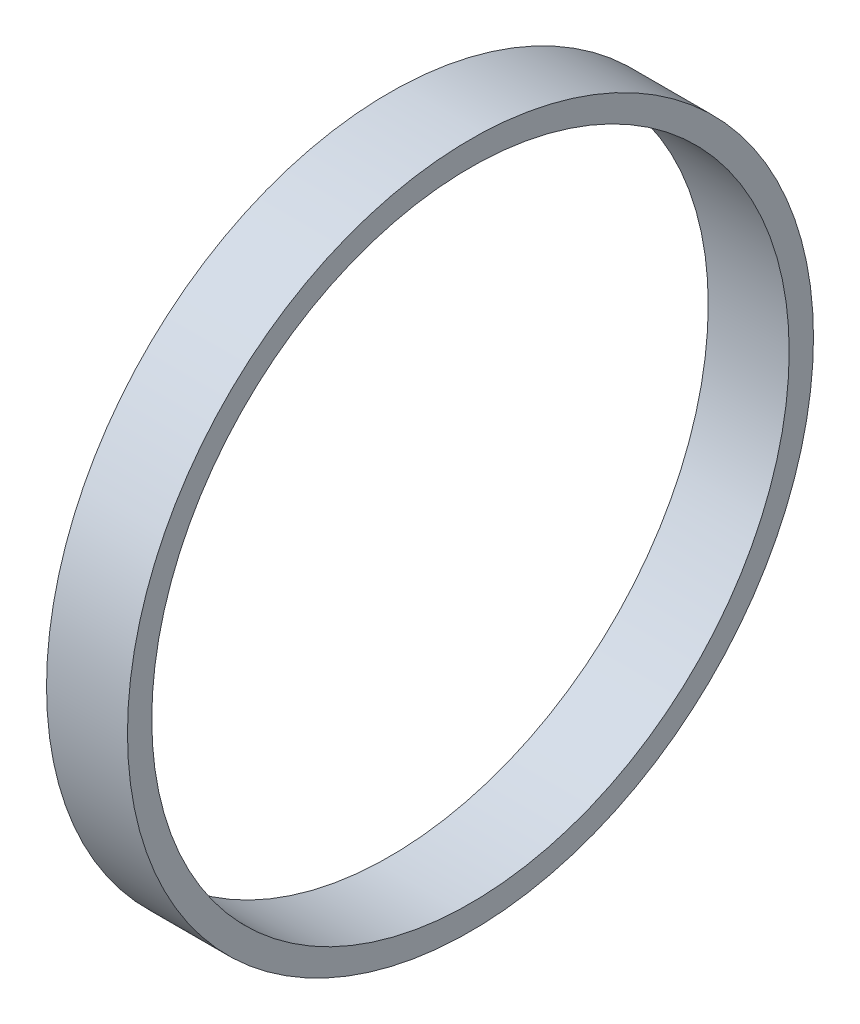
from build123d import *

# Parameters (mm, degrees)
ESQUISSE1_W = 8
ESQUISSE1_H = 2.4


with BuildPart() as part:
    # Esquisse1 → R_volution1 (revolve)
    with BuildSketch(Plane.XY, mode=Mode.PRIVATE) as r_volution1_sk:
        with Locations((4, 32.7)):
            Rectangle(ESQUISSE1_W, ESQUISSE1_H)
    revolve(r_volution1_sk.sketch.rotate(Axis((0, 0, 0), (1, 0, 0)), 90), axis=Axis((0, 0, 0), (1, 0, 0)))


solid = part.part
